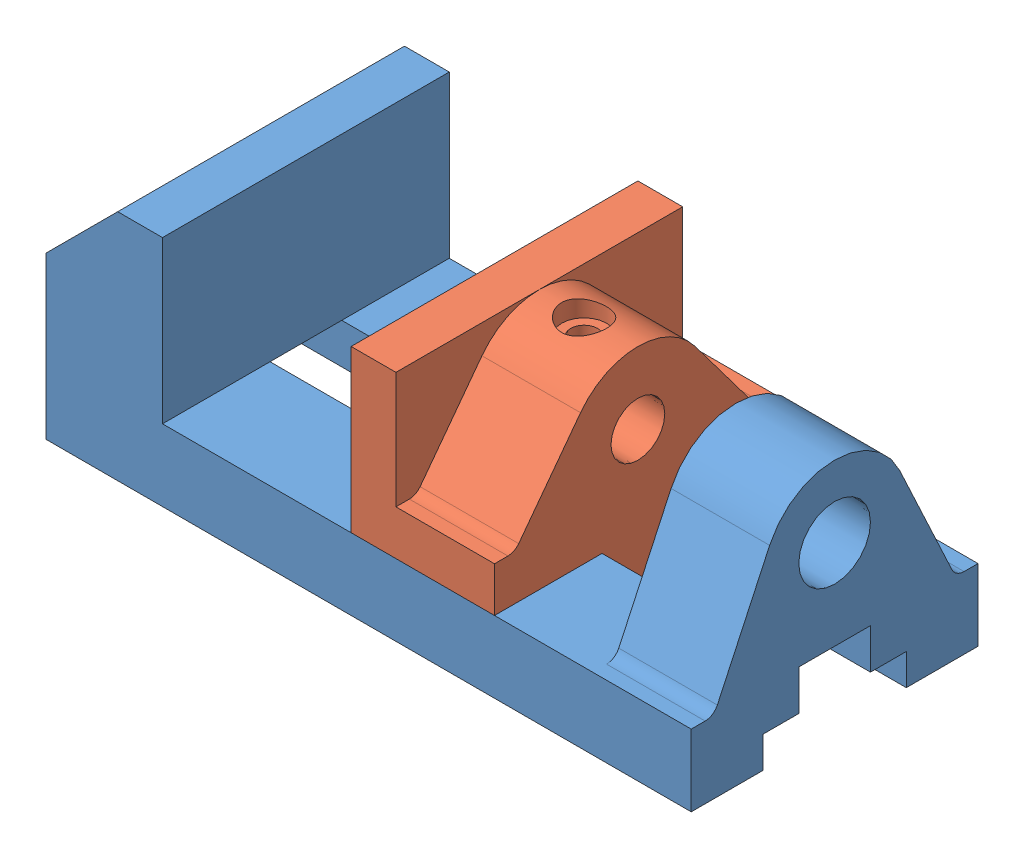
SolidWorks assembly Assem.SLDASM, configuration Default (file format 11000). Lengths in mm.
Overall size (144 52 64).
2 component instances, 2 part files, 2 mates.
Components (placement in the parent):
- vice-body-1: vice-body.SLDPRT [Default] at (-137.3635 -16.3934 27.9648) size (144 52 64)
- vice-jaw-2: vice-jaw.SLDPRT [Default] at (-69.268 13.6066 27.9648) x (0 0 -1) z (1 0 0) size (64 45 32)
Mates (geometry in assembly coordinates):
- Coincident11: coincident: plane of assembly; plane of assembly; plane of vice-body-1 through (6.6365 -0.3934 59.9648) normal (0 1 0); plane of vice-jaw-2 through (-37.268 -0.3934 59.9648) normal (0 -1 0)
- Coincident14: coincident: plane of assembly; plane of assembly; plane of vice-body-1 through (-137.3635 -16.3934 59.9648) normal (0 0 1); plane of vice-jaw-2 through (-37.268 35.6066 59.9648) normal (0 0 1)
